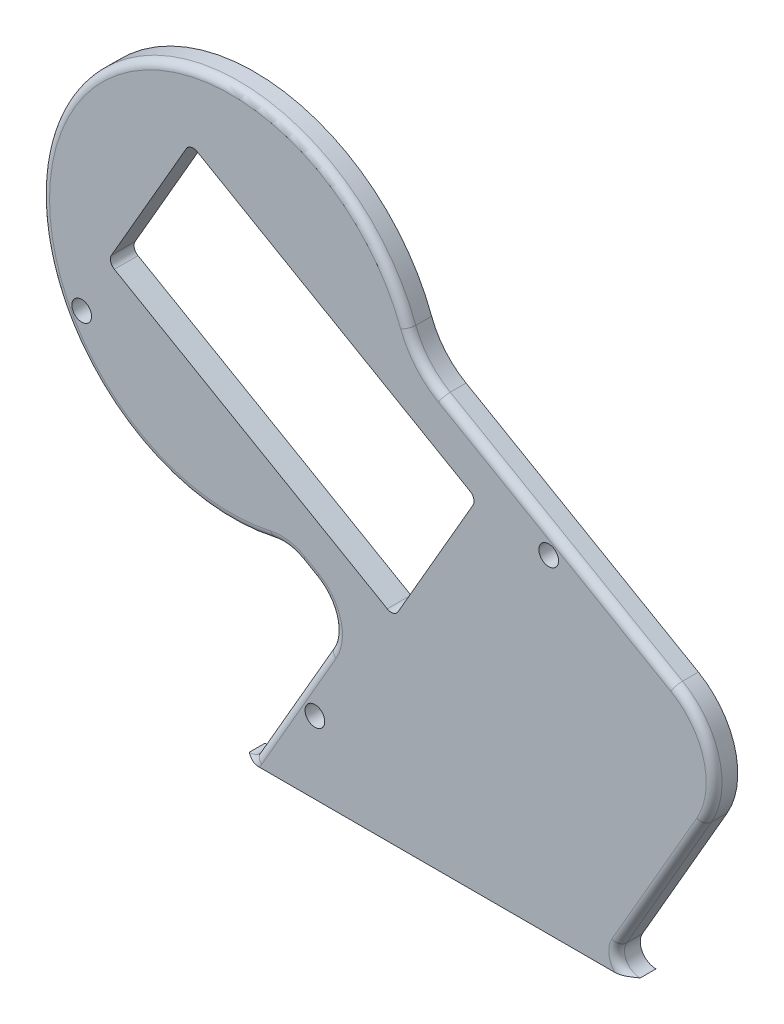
from build123d import *

# Parameters (mm, degrees)
BOSS_EXTRUDE1_DEPTH = 3
FILLET1_R           = 1
M3_TAPPED_HOLE1_D   = 2.5
CUT_EXTRUDE3_START  = -3
CUT_EXTRUDE3_DEPTH  = 92.066937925
FILLET2_R           = 1


with BuildPart() as part:
    # Sketch1 → Boss-Extrude1 (new body)
    with BuildSketch(Plane.XY):
        with BuildLine():
            Line((-14.330127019, 24.150635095), (-16.08452071, 25.163534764))
            ThreePointArc((-16.08452071, 25.163534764), (-17.83602001, 25.777064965), (-19.690637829, 25.709523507))
            ThreePointArc((-19.690637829, 25.709523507), (-46.11435696, 60.524696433), (-2.512120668, 57.499107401))
            ThreePointArc((-2.512120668, 57.499107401), (-0.777476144, 54.534818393), (1.857829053, 52.332281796))
            Line((1.857829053, 52.332281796), (31.339745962, 35.310889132))
            ThreePointArc((31.339745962, 35.310889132), (35.999004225, 29.238825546), (35, 21.650635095))
            Line((35, 21.650635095), (24.232050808, 3))
            ThreePointArc((24.232050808, 3), (24.232050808, 1), (25.964101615, 0))
            Line((25.964101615, 0), (-23.654700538, 0))
            ThreePointArc((-23.654700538, 0), (-22.654700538, 0.267949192), (-21.922649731, 1))
            Line((-21.922649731, 1), (-12.5, 17.320508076))
            ThreePointArc((-12.5, 17.320508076), (-12.000497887, 21.114603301), (-14.330127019, 24.150635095))
        make_face()
    extrude(amount=BOSS_EXTRUDE1_DEPTH)

    # Fillet1
    fillet1_edges = [part.edges().sort_by_distance(p)[0] for p in [
        (35.999004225, 29.238825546, 3),
        (29.616025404, 12.325317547, 3),
        (24.232050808, 1, 3),
        (-22.654700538, 0.267949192, 3),
        (-17.211324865, 9.160254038, 3),
        (-12.000497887, 21.114603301, 3),
        (-15.207323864, 24.657084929, 3),
        (-17.83602001, 25.777064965, 3),
        (-46.11435696, 60.524696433, 3),
        (-0.777476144, 54.534818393, 3),
        (16.598787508, 43.821585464, 3),
    ]]
    fillet(fillet1_edges, radius=FILLET1_R)

    # M3 Tapped Hole1 (through all)
    with Locations(Plane.XY.offset(3)):
        with Locations((-43.914944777, 38.893584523), (15.348787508, 41.656521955), (-14.324573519, 9.160254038)):
            Hole(M3_TAPPED_HOLE1_D / 2)

    # Sketch4 → Cut-Extrude3 (cut, through all)
    with BuildSketch(Plane.XY.offset(3).offset(CUT_EXTRUDE3_START)):
        Polygon((-30.142304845, 64.208145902), (-40.642304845, 46.021612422), (-4.269237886, 25.021612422), (6.230762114, 43.208145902), align=None)
    extrude(amount=CUT_EXTRUDE3_DEPTH, mode=Mode.SUBTRACT)

    # Fillet2
    fillet2_edges = [part.edges().sort_by_distance(p)[0] for p in [
        (-40.642304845, 46.021612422, 1.5),
        (-4.269237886, 25.021612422, 1.5),
        (6.230762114, 43.208145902, 1.5),
        (-30.142304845, 64.208145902, 1.5),
    ]]
    fillet(fillet2_edges, radius=FILLET2_R)


solid = part.part
